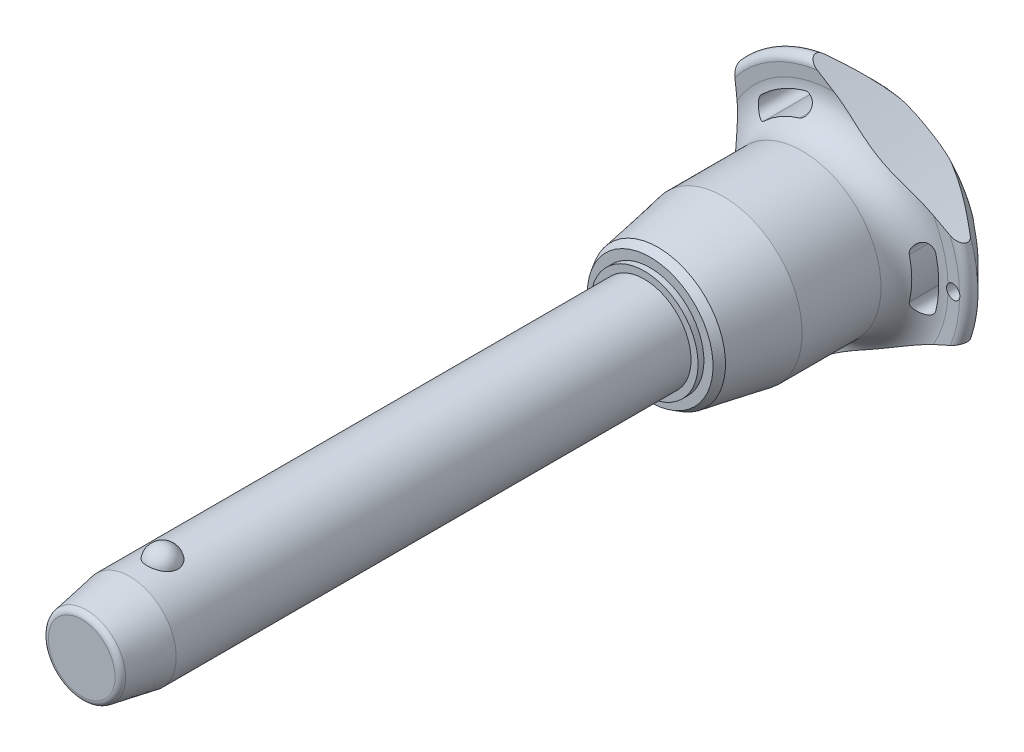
from build123d import *

# Parameters (mm, degrees)
SKETCH1_R           = 10
BOSS_EXTRUDE1_DEPTH = 100
SKETCH2_R           = 8.75
BOSS_EXTRUDE2_DEPTH = 50.7
BOSS_EXTRUDE3_START = 20.5
SKETCH1_2_R         = 10
BOSS_EXTRUDE3_DEPTH = 20.5
CHAMFER1_SIZE       = 10.25
CHAMFER1_SIZE2      = 1.807351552
FILLET1_R           = 1.25
SKETCH6_R           = 176.92625
CUT_EXTRUDE1_DEPTH  = 157.015516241
CIRPATTERN1_COUNT   = 3
SKETCH7_R           = 1.5
CUT_EXTRUDE2_DEPTH  = 156.917913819


with BuildPart() as part:
    # Sketch1 → Boss-Extrude1 (new body)
    with BuildSketch(Plane.XY):
        Circle(SKETCH1_R)
    extrude(amount=-BOSS_EXTRUDE1_DEPTH)

    # Sketch2 → Boss-Extrude2 (add)
    with BuildSketch(Plane(origin=(0, 0, -100), x_dir=(-1, 0, 0), z_dir=(0, 0, -1))):
        with Locations(Location((0, 0, 0), (0, 0, 180))):
            Circle(SKETCH2_R)
    extrude(amount=BOSS_EXTRUDE2_DEPTH)

    # Sketch3 → Revolve1 (revolve)
    with BuildSketch(Plane(origin=(0, 0, 0), x_dir=(0, 0, -1), z_dir=(1, 0, 0))):
        with BuildLine():
            Line((-3.201562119, 12.5), (-3.201562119, 5.9))
            ThreePointArc((-3.201562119, 5.9), (0.098437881, 9.2), (-3.201562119, 12.5))
        make_face()
        with BuildLine():
            Line((-3.201562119, -5.9), (-3.201562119, -12.5))
            ThreePointArc((-3.201562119, -12.5), (0.098437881, -9.2), (-3.201562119, -5.9))
        make_face()
    revolve(axis=Axis((0, -5.9, 3.201562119), (0, 1, 0)))

    # Sketch1_2 → Boss-Extrude3 (add)
    with BuildSketch(Plane.XY.offset(BOSS_EXTRUDE3_START)):
        Circle(SKETCH1_2_R)
    extrude(amount=-BOSS_EXTRUDE3_DEPTH)

    # Chamfer1
    chamfer1_edges = [part.edges().sort_by_distance(p)[0] for p in [
        (-10, 0, 20.5),
    ]]
    chamfer1_side = [part.faces().sort_by_distance(p)[0] for p in [
        (-10, 0, -39.75),
    ]]
    chamfer(chamfer1_edges, length=CHAMFER1_SIZE, length2=CHAMFER1_SIZE2, reference=chamfer1_side[0])

    # Fillet1
    fillet1_edges = [part.edges().sort_by_distance(p)[0] for p in [
        (-8.192648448, 0, 20.5),
        (-8.75, 0, -150.7),
    ]]
    fillet(fillet1_edges, radius=FILLET1_R)

    # Sketch4 → Revolve2 (revolve)
    with BuildSketch(Plane(origin=(0, 0, 0), x_dir=(0, 0, -1), z_dir=(1, 0, 0)), mode=Mode.PRIVATE) as revolve2_sk:
        Polygon((100, 0), (100, 11.504815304), (101.25, 11.504815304), (101.25, 13.461079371), (102.944174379, 14.439211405), (116.9, 16.9), (133.8, 16.9), (133.8, 0), align=None)
    revolve(revolve2_sk.sketch.rotate(Axis((0, 0, -133.8), (0, 0, 1)), 90), axis=Axis((0, 0, -133.8), (0, 0, 1)))

    # Sketch5 → Revolve3 (revolve)
    with BuildSketch(Plane(origin=(0, 0, 0), x_dir=(0, 0, -1), z_dir=(1, 0, 0)), mode=Mode.PRIVATE) as revolve3_sk:
        with BuildLine():
            Line((140.790129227, 24.271609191), (140.652256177, 26.865060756))
            ThreePointArc((140.652256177, 26.865060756), (141.598671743, 28.411427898), (143.38137085, 28.08137085))
            Line((143.38137085, 28.08137085), (149.763226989, 21.69951471))
            ThreePointArc((149.763226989, 21.69951471), (150.7, 19.381044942), (149.683055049, 17.096604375))
            ThreePointArc((149.683055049, 17.096604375), (144.18864484, 9.321268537), (142.25, 0))
            Line((142.25, 0), (133.8, 0))
            Line((133.8, 0), (133.8, 16.9))
            ThreePointArc((133.8, 16.9), (138.879432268, 19.083427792), (140.790129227, 24.271609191))
        make_face()
    revolve(revolve3_sk.sketch.rotate(Axis((0, 0, -142.25), (0, 0, 1)), 90), axis=Axis((0, 0, -142.25), (0, 0, 1)))

    # Sketch6 → Cut-Extrude1 (cut, through all)
    with BuildSketch(Plane.XY):
        with Locations((-197.42625, 0)):
            Circle(SKETCH6_R)
        with BuildLine():
            ThreePointArc((21.802992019, -5.260839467), (22.428706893, 0), (21.802992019, 5.260839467))
            ThreePointArc((21.802992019, 5.260839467), (19.579234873, 6.620060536), (18.220013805, 4.39630339))
            ThreePointArc((18.220013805, 4.39630339), (18.742902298, 0), (18.220013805, -4.39630339))
            ThreePointArc((18.220013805, -4.39630339), (19.579234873, -6.620060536), (21.802992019, -5.260839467))
        make_face()
    cut_extrude1 = extrude(amount=-CUT_EXTRUDE1_DEPTH, mode=Mode.SUBTRACT)

    # CirPattern1: Cut-Extrude1 ×3 about axis
    cirpattern1_axis = Axis((0, 0, 0), (0, 0, 1))
    for i in range(1, CIRPATTERN1_COUNT):
        add(cut_extrude1.rotate(cirpattern1_axis, i * 360 / CIRPATTERN1_COUNT), mode=Mode.SUBTRACT)

    # Sketch7 → Cut-Extrude2 (cut, through all)
    with BuildSketch(Plane.XY):
        with Locations(Location((25.428706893, 0, 0), (0, 0, 17.230769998))):
            Circle(SKETCH7_R)
    extrude(amount=-CUT_EXTRUDE2_DEPTH, mode=Mode.SUBTRACT)


solid = part.part
